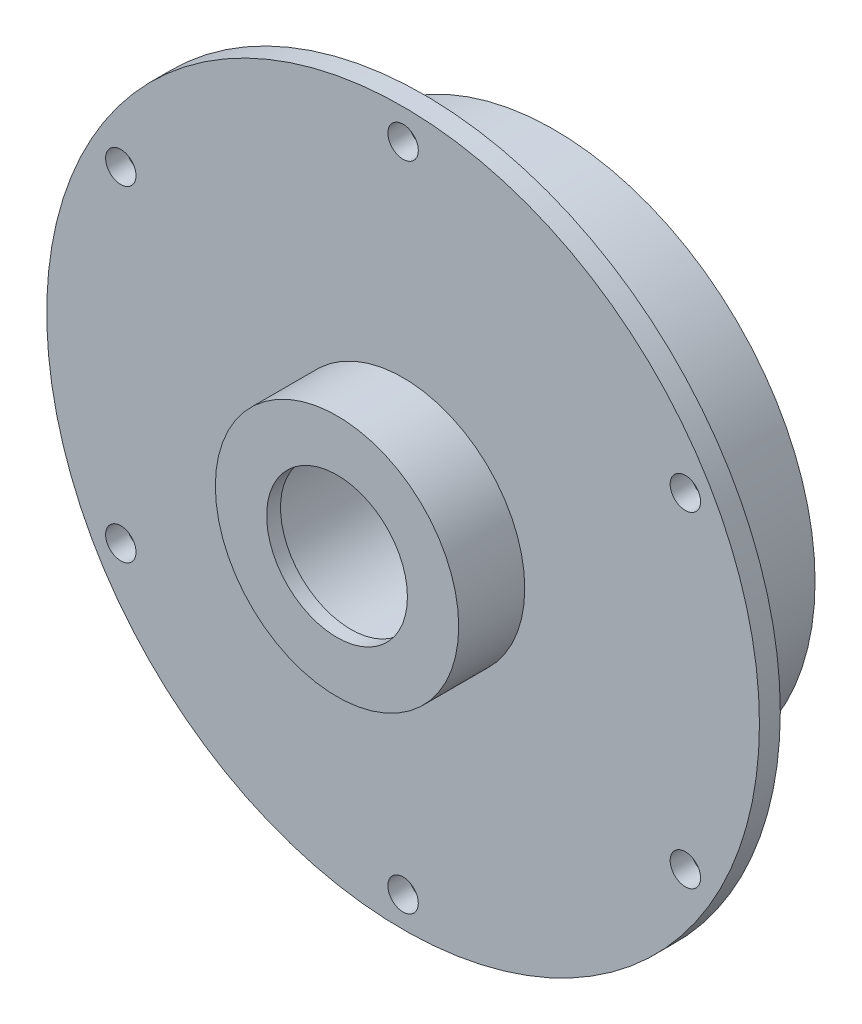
from build123d import *

# Parameters (mm, degrees)
CIRPATTERN1_COUNT = 6
CIRPATTERN2_COUNT = 6
CIRPATTERN3_COUNT = 6


with BuildPart() as part:
    # Sketch1 → Revolve1 (revolve)
    with BuildSketch(Plane(origin=(0, 0, 0), x_dir=(0, 0, -1), z_dir=(1, 0, 0)), mode=Mode.PRIVATE) as revolve1_sk:
        Polygon((8, 40.5), (0, 40.5), (0, 70), (38, 70), (38, 205), (50, 205), (50, 150), (125, 150), (125, 110), (50, 110), (50, 70), (65, 70), (65, 50), (8, 50), align=None)
    revolve(revolve1_sk.sketch.rotate(Axis((0, 0, 0), (0, 0, -1)), 90), axis=Axis((0, 0, 0), (0, 0, -1)))

    # Sketch4 → M16 Tapped Hole1 (revolve, cut)
    with BuildSketch(Plane(origin=(0, 130, -125), x_dir=(0, 1, 0), z_dir=(1, 0, 0))):
        Polygon((0, 0), (0, 52.206024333), (7, 48), (7, 0), align=None)
    m16_tapped_hole1 = revolve(axis=Axis((0, 130, -131.35), (0, 0, 1)), mode=Mode.SUBTRACT)

    # CirPattern1: M16 Tapped Hole1 ×6 about axis
    cirpattern1_axis = Axis((0, 0, 0), (0, 0, 1))
    for i in range(1, CIRPATTERN1_COUNT):
        add(m16_tapped_hole1.rotate(cirpattern1_axis, i * 360 / CIRPATTERN1_COUNT), mode=Mode.SUBTRACT)

    # Sketch8 → 17.5 _17.5_ Diameter Hole2 (revolve, cut)
    with BuildSketch(Plane(origin=(0, 187.5, -38), x_dir=(0, -1, 0), z_dir=(1, 0, 0))):
        Polygon((0, 0), (0, 31.257530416), (8.75, 26), (8.75, 0), align=None)
    f_17_5_17_5_diameter_hole2 = revolve(axis=Axis((0, 187.5, -31.65), (0, 0, -1)), mode=Mode.SUBTRACT)

    # CirPattern2: 17.5 _17.5_ Diameter Hole2 ×6 about axis
    cirpattern2_axis = Axis((0, 0, 0), (0, 0, 1))
    for i in range(1, CIRPATTERN2_COUNT):
        add(f_17_5_17_5_diameter_hole2.rotate(cirpattern2_axis, i * 360 / CIRPATTERN2_COUNT), mode=Mode.SUBTRACT)

    # Sketch11 → M8 Tapped Hole1 (revolve, cut)
    with BuildSketch(Plane(origin=(0, 60, -65), x_dir=(0, 1, 0), z_dir=(1, 0, 0))):
        Polygon((0, 0), (0, 27.042926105), (3.4, 25), (3.4, 0), align=None)
    m8_tapped_hole1 = revolve(axis=Axis((0, 60, -71.35), (0, 0, 1)), mode=Mode.SUBTRACT)

    # CirPattern3: M8 Tapped Hole1 ×6 about axis
    cirpattern3_axis = Axis((0, 0, 0), (0, 0, 1))
    for i in range(1, CIRPATTERN3_COUNT):
        add(m8_tapped_hole1.rotate(cirpattern3_axis, i * 360 / CIRPATTERN3_COUNT), mode=Mode.SUBTRACT)


solid = part.part
